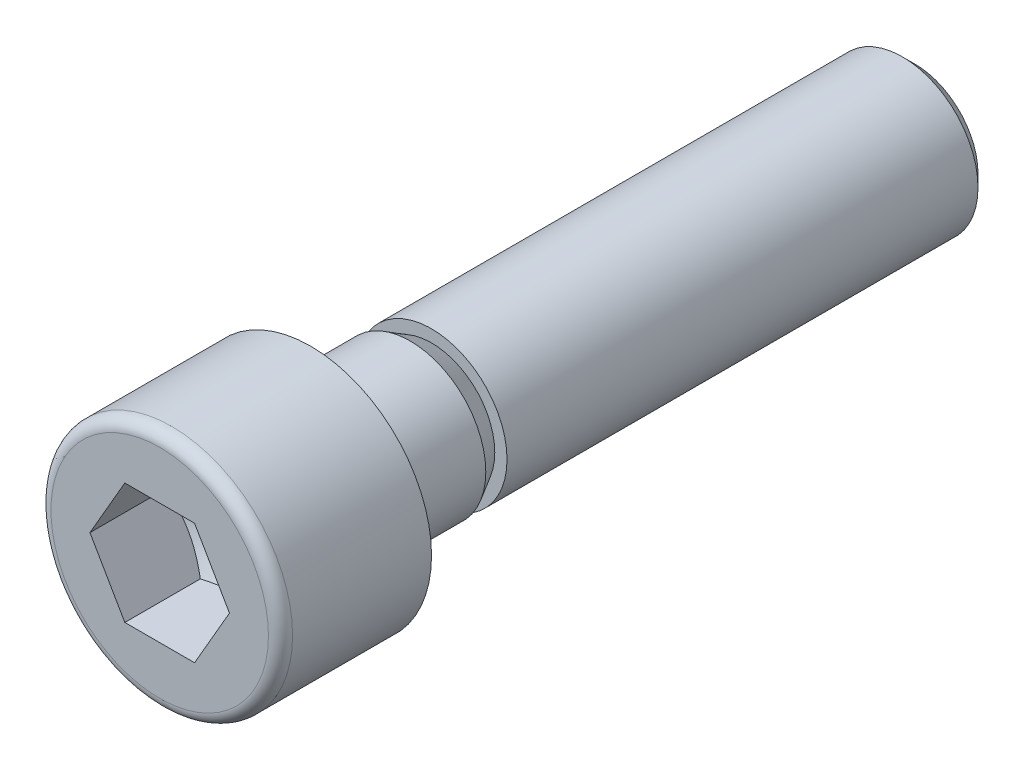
ISO-10303-21;
HEADER;
FILE_DESCRIPTION(('STEP AP214'),'2;1');
FILE_NAME('part.step','',(''),(''),'','','');
FILE_SCHEMA(('AUTOMOTIVE_DESIGN { 1 0 10303 214 1 1 1 1 }'));
ENDSEC;
DATA;
#1=APPLICATION_CONTEXT('core data for automotive mechanical design processes');
#2=APPLICATION_PROTOCOL_DEFINITION('international standard','automotive_design',2000,#1);
#3=PRODUCT_CONTEXT('',#1,'mechanical');
#4=PRODUCT('Part','Part','',(#3));
#5=PRODUCT_RELATED_PRODUCT_CATEGORY('part','',(#4));
#6=PRODUCT_DEFINITION_FORMATION('','',#4);
#7=PRODUCT_DEFINITION_CONTEXT('part definition',#1,'design');
#8=PRODUCT_DEFINITION('design','',#6,#7);
#9=PRODUCT_DEFINITION_SHAPE('','',#8);
#10=(LENGTH_UNIT() NAMED_UNIT(*) SI_UNIT(.MILLI.,.METRE.));
#11=(NAMED_UNIT(*) PLANE_ANGLE_UNIT() SI_UNIT($,.RADIAN.));
#12=(NAMED_UNIT(*) SI_UNIT($,.STERADIAN.) SOLID_ANGLE_UNIT());
#13=UNCERTAINTY_MEASURE_WITH_UNIT(LENGTH_MEASURE(1.E-05),#10,'distance_accuracy_value','');
#14=(GEOMETRIC_REPRESENTATION_CONTEXT(3) GLOBAL_UNCERTAINTY_ASSIGNED_CONTEXT((#13)) GLOBAL_UNIT_ASSIGNED_CONTEXT((#10,
#11,#12)) REPRESENTATION_CONTEXT('',''));
#15=CARTESIAN_POINT('',(0.,0.,0.));
#16=DIRECTION('',(0.,0.,1.));
#17=DIRECTION('',(1.,0.,0.));
#18=AXIS2_PLACEMENT_3D('',#15,#16,#17);
#19=CARTESIAN_POINT('',(0.,0.,10.));
#20=DIRECTION('',(0.,0.,1.));
#21=DIRECTION('',(1.,0.,0.));
#22=AXIS2_PLACEMENT_3D('',#19,#20,#21);
#23=PLANE('',#22);
#24=CARTESIAN_POINT('',(0.,0.,10.));
#25=DIRECTION('',(0.,0.,1.));
#26=DIRECTION('',(1.,0.,0.));
#27=AXIS2_PLACEMENT_3D('',#24,#25,#26);
#28=CIRCLE('',#27,7.2);
#29=CARTESIAN_POINT('',(7.2,0.,10.));
#30=VERTEX_POINT('',#29);
#31=EDGE_CURVE('E11',#30,#30,#28,.T.);
#32=ORIENTED_EDGE('',*,*,#31,.T.);
#33=EDGE_LOOP('',(#32));
#34=FACE_BOUND('',#33,.T.);
#35=DIRECTION('',(1.,0.,0.));
#36=VECTOR('',#35,1.);
#37=CARTESIAN_POINT('',(-2.3094,3.99999813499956,10.));
#38=LINE('',#37,#36);
#39=CARTESIAN_POINT('',(-2.3094,3.99999813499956,10.));
#40=VERTEX_POINT('',#39);
#41=CARTESIAN_POINT('',(2.3094,3.99999813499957,10.));
#42=VERTEX_POINT('',#41);
#43=EDGE_CURVE('E92',#40,#42,#38,.T.);
#44=ORIENTED_EDGE('',*,*,#43,.T.);
#45=DIRECTION('',(0.5,-0.866025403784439,0.));
#46=VECTOR('',#45,1.);
#47=CARTESIAN_POINT('',(2.3094,3.99999813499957,10.));
#48=LINE('',#47,#46);
#49=CARTESIAN_POINT('',(4.6188,0.,10.));
#50=VERTEX_POINT('',#49);
#51=EDGE_CURVE('E31',#42,#50,#48,.T.);
#52=ORIENTED_EDGE('',*,*,#51,.T.);
#53=DIRECTION('',(-0.5,-0.866025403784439,0.));
#54=VECTOR('',#53,1.);
#55=CARTESIAN_POINT('',(4.6188,0.,10.));
#56=LINE('',#55,#54);
#57=CARTESIAN_POINT('',(2.3094,-3.99999813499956,10.));
#58=VERTEX_POINT('',#57);
#59=EDGE_CURVE('E169',#50,#58,#56,.T.);
#60=ORIENTED_EDGE('',*,*,#59,.T.);
#61=DIRECTION('',(-1.,0.,0.));
#62=VECTOR('',#61,1.);
#63=CARTESIAN_POINT('',(2.3094,-3.99999813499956,10.));
#64=LINE('',#63,#62);
#65=CARTESIAN_POINT('',(-2.3094,-3.99999813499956,10.));
#66=VERTEX_POINT('',#65);
#67=EDGE_CURVE('E165',#58,#66,#64,.T.);
#68=ORIENTED_EDGE('',*,*,#67,.T.);
#69=DIRECTION('',(-0.5,0.866025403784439,0.));
#70=VECTOR('',#69,1.);
#71=CARTESIAN_POINT('',(-2.3094,-3.99999813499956,10.));
#72=LINE('',#71,#70);
#73=CARTESIAN_POINT('',(-4.6188,0.,10.));
#74=VERTEX_POINT('',#73);
#75=EDGE_CURVE('E160',#66,#74,#72,.T.);
#76=ORIENTED_EDGE('',*,*,#75,.T.);
#77=DIRECTION('',(0.5,0.866025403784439,0.));
#78=VECTOR('',#77,1.);
#79=CARTESIAN_POINT('',(-4.6188,0.,10.));
#80=LINE('',#79,#78);
#81=EDGE_CURVE('E96',#74,#40,#80,.T.);
#82=ORIENTED_EDGE('',*,*,#81,.T.);
#83=EDGE_LOOP('',(#44,#52,#60,#68,#76,#82));
#84=FACE_BOUND('',#83,.T.);
#85=ADVANCED_FACE('F17',(#34,#84),#23,.T.);
#86=CARTESIAN_POINT('',(0.,0.,9.2));
#87=DIRECTION('',(0.,0.,1.));
#88=DIRECTION('',(1.,0.,0.));
#89=AXIS2_PLACEMENT_3D('',#86,#87,#88);
#90=TOROIDAL_SURFACE('',#89,7.2,0.8);
#91=ORIENTED_EDGE('',*,*,#31,.F.);
#92=EDGE_LOOP('',(#91));
#93=FACE_BOUND('',#92,.T.);
#94=CARTESIAN_POINT('',(0.,0.,9.2));
#95=DIRECTION('',(0.,0.,1.));
#96=DIRECTION('',(1.,0.,0.));
#97=AXIS2_PLACEMENT_3D('',#94,#95,#96);
#98=CIRCLE('',#97,8.);
#99=CARTESIAN_POINT('',(8.,0.,9.2));
#100=VERTEX_POINT('',#99);
#101=EDGE_CURVE('E24',#100,#100,#98,.T.);
#102=ORIENTED_EDGE('',*,*,#101,.T.);
#103=EDGE_LOOP('',(#102));
#104=FACE_BOUND('',#103,.T.);
#105=ADVANCED_FACE('F133',(#93,#104),#90,.T.);
#106=CARTESIAN_POINT('',(0.,0.,10.));
#107=DIRECTION('',(0.,0.,1.));
#108=DIRECTION('',(1.,0.,0.));
#109=AXIS2_PLACEMENT_3D('',#106,#107,#108);
#110=CYLINDRICAL_SURFACE('',#109,8.);
#111=CARTESIAN_POINT('',(0.,0.,0.));
#112=DIRECTION('',(0.,0.,1.));
#113=DIRECTION('',(1.,0.,0.));
#114=AXIS2_PLACEMENT_3D('',#111,#112,#113);
#115=CIRCLE('',#114,8.);
#116=CARTESIAN_POINT('',(8.,0.,0.));
#117=VERTEX_POINT('',#116);
#118=EDGE_CURVE('E128',#117,#117,#115,.T.);
#119=ORIENTED_EDGE('',*,*,#118,.T.);
#120=EDGE_LOOP('',(#119));
#121=FACE_BOUND('',#120,.T.);
#122=ORIENTED_EDGE('',*,*,#101,.F.);
#123=EDGE_LOOP('',(#122));
#124=FACE_BOUND('',#123,.T.);
#125=ADVANCED_FACE('F135',(#121,#124),#110,.T.);
#126=CARTESIAN_POINT('',(0.,8.,0.));
#127=DIRECTION('',(0.,0.,-1.));
#128=DIRECTION('',(-1.,0.,0.));
#129=AXIS2_PLACEMENT_3D('',#126,#127,#128);
#130=PLANE('',#129);
#131=CARTESIAN_POINT('',(0.,0.,0.));
#132=DIRECTION('',(0.,0.,1.));
#133=DIRECTION('',(1.,0.,0.));
#134=AXIS2_PLACEMENT_3D('',#131,#132,#133);
#135=CIRCLE('',#134,5.5);
#136=CARTESIAN_POINT('',(5.5,0.,0.));
#137=VERTEX_POINT('',#136);
#138=EDGE_CURVE('E125',#137,#137,#135,.T.);
#139=ORIENTED_EDGE('',*,*,#138,.T.);
#140=EDGE_LOOP('',(#139));
#141=FACE_BOUND('',#140,.T.);
#142=ORIENTED_EDGE('',*,*,#118,.F.);
#143=EDGE_LOOP('',(#142));
#144=FACE_BOUND('',#143,.T.);
#145=ADVANCED_FACE('F137',(#141,#144),#130,.T.);
#146=CARTESIAN_POINT('',(0.,0.,-0.5));
#147=DIRECTION('',(0.,0.,1.));
#148=DIRECTION('',(1.,0.,0.));
#149=AXIS2_PLACEMENT_3D('',#146,#147,#148);
#150=TOROIDAL_SURFACE('',#149,5.5,0.5);
#151=CARTESIAN_POINT('',(0.,0.,-0.5));
#152=DIRECTION('',(0.,0.,1.));
#153=DIRECTION('',(1.,0.,0.));
#154=AXIS2_PLACEMENT_3D('',#151,#152,#153);
#155=CIRCLE('',#154,5.);
#156=CARTESIAN_POINT('',(5.,0.,-0.5));
#157=VERTEX_POINT('',#156);
#158=EDGE_CURVE('E122',#157,#157,#155,.T.);
#159=ORIENTED_EDGE('',*,*,#158,.T.);
#160=EDGE_LOOP('',(#159));
#161=FACE_BOUND('',#160,.T.);
#162=ORIENTED_EDGE('',*,*,#138,.F.);
#163=EDGE_LOOP('',(#162));
#164=FACE_BOUND('',#163,.T.);
#165=ADVANCED_FACE('F145',(#161,#164),#150,.F.);
#166=CARTESIAN_POINT('',(0.,0.,10.));
#167=DIRECTION('',(0.,0.,1.));
#168=DIRECTION('',(1.,0.,0.));
#169=AXIS2_PLACEMENT_3D('',#166,#167,#168);
#170=CYLINDRICAL_SURFACE('',#169,5.);
#171=CARTESIAN_POINT('',(0.,0.,-6.59379125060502));
#172=DIRECTION('',(0.,0.,1.));
#173=DIRECTION('',(1.,0.,0.));
#174=AXIS2_PLACEMENT_3D('',#171,#172,#173);
#175=CIRCLE('',#174,5.);
#176=CARTESIAN_POINT('',(5.,0.,-6.59379125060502));
#177=VERTEX_POINT('',#176);
#178=EDGE_CURVE('E119',#177,#177,#175,.T.);
#179=ORIENTED_EDGE('',*,*,#178,.T.);
#180=EDGE_LOOP('',(#179));
#181=FACE_BOUND('',#180,.T.);
#182=ORIENTED_EDGE('',*,*,#158,.F.);
#183=EDGE_LOOP('',(#182));
#184=FACE_BOUND('',#183,.T.);
#185=ADVANCED_FACE('F343',(#181,#184),#170,.T.);
#186=CARTESIAN_POINT('',(0.,0.,-6.59379125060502));
#187=DIRECTION('',(0.,0.,1.));
#188=DIRECTION('',(1.,0.,0.));
#189=AXIS2_PLACEMENT_3D('',#186,#187,#188);
#190=CONICAL_SURFACE('',#189,5.,0.523598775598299);
#191=CARTESIAN_POINT('',(0.,0.,-8.));
#192=DIRECTION('',(0.,0.,1.));
#193=DIRECTION('',(1.,0.,0.));
#194=AXIS2_PLACEMENT_3D('',#191,#192,#193);
#195=CIRCLE('',#194,4.188125);
#196=CARTESIAN_POINT('',(4.188125,0.,-8.));
#197=VERTEX_POINT('',#196);
#198=EDGE_CURVE('E116',#197,#197,#195,.T.);
#199=ORIENTED_EDGE('',*,*,#198,.T.);
#200=EDGE_LOOP('',(#199));
#201=FACE_BOUND('',#200,.T.);
#202=ORIENTED_EDGE('',*,*,#178,.F.);
#203=EDGE_LOOP('',(#202));
#204=FACE_BOUND('',#203,.T.);
#205=ADVANCED_FACE('F332',(#201,#204),#190,.T.);
#206=CARTESIAN_POINT('',(0.,4.188125,-8.));
#207=DIRECTION('',(0.,0.,1.));
#208=DIRECTION('',(1.,0.,0.));
#209=AXIS2_PLACEMENT_3D('',#206,#207,#208);
#210=PLANE('',#209);
#211=CARTESIAN_POINT('',(0.,0.,-8.));
#212=DIRECTION('',(0.,0.,1.));
#213=DIRECTION('',(1.,0.,0.));
#214=AXIS2_PLACEMENT_3D('',#211,#212,#213);
#215=CIRCLE('',#214,5.);
#216=CARTESIAN_POINT('',(5.,0.,-8.));
#217=VERTEX_POINT('',#216);
#218=EDGE_CURVE('E113',#217,#217,#215,.T.);
#219=ORIENTED_EDGE('',*,*,#218,.T.);
#220=EDGE_LOOP('',(#219));
#221=FACE_BOUND('',#220,.T.);
#222=ORIENTED_EDGE('',*,*,#198,.F.);
#223=EDGE_LOOP('',(#222));
#224=FACE_BOUND('',#223,.T.);
#225=ADVANCED_FACE('F321',(#221,#224),#210,.T.);
#226=CARTESIAN_POINT('',(0.,0.,10.));
#227=DIRECTION('',(0.,0.,1.));
#228=DIRECTION('',(1.,0.,0.));
#229=AXIS2_PLACEMENT_3D('',#226,#227,#228);
#230=CYLINDRICAL_SURFACE('',#229,5.);
#231=CARTESIAN_POINT('',(0.,0.,-39.188125));
#232=DIRECTION('',(0.,0.,1.));
#233=DIRECTION('',(1.,0.,0.));
#234=AXIS2_PLACEMENT_3D('',#231,#232,#233);
#235=CIRCLE('',#234,5.);
#236=CARTESIAN_POINT('',(5.,0.,-39.188125));
#237=VERTEX_POINT('',#236);
#238=EDGE_CURVE('E110',#237,#237,#235,.T.);
#239=ORIENTED_EDGE('',*,*,#238,.T.);
#240=EDGE_LOOP('',(#239));
#241=FACE_BOUND('',#240,.T.);
#242=ORIENTED_EDGE('',*,*,#218,.F.);
#243=EDGE_LOOP('',(#242));
#244=FACE_BOUND('',#243,.T.);
#245=ADVANCED_FACE('F310',(#241,#244),#230,.T.);
#246=CARTESIAN_POINT('',(0.,0.,-39.188125));
#247=DIRECTION('',(0.,0.,1.));
#248=DIRECTION('',(1.,0.,0.));
#249=AXIS2_PLACEMENT_3D('',#246,#247,#248);
#250=CONICAL_SURFACE('',#249,5.,0.785398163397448);
#251=CARTESIAN_POINT('',(0.,0.,-40.));
#252=DIRECTION('',(0.,0.,1.));
#253=DIRECTION('',(1.,0.,0.));
#254=AXIS2_PLACEMENT_3D('',#251,#252,#253);
#255=CIRCLE('',#254,4.188125);
#256=CARTESIAN_POINT('',(4.188125,0.,-40.));
#257=VERTEX_POINT('',#256);
#258=EDGE_CURVE('E107',#257,#257,#255,.T.);
#259=ORIENTED_EDGE('',*,*,#258,.T.);
#260=EDGE_LOOP('',(#259));
#261=FACE_BOUND('',#260,.T.);
#262=ORIENTED_EDGE('',*,*,#238,.F.);
#263=EDGE_LOOP('',(#262));
#264=FACE_BOUND('',#263,.T.);
#265=ADVANCED_FACE('F300',(#261,#264),#250,.T.);
#266=CARTESIAN_POINT('',(0.,4.188125,-40.));
#267=DIRECTION('',(0.,0.,-1.));
#268=DIRECTION('',(-1.,0.,0.));
#269=AXIS2_PLACEMENT_3D('',#266,#267,#268);
#270=PLANE('',#269);
#271=ORIENTED_EDGE('',*,*,#258,.F.);
#272=EDGE_LOOP('',(#271));
#273=FACE_BOUND('',#272,.T.);
#274=ADVANCED_FACE('F225',(#273),#270,.T.);
#275=CARTESIAN_POINT('',(2.3094,3.99999813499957,2.33333457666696));
#276=DIRECTION('',(-0.866025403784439,-0.5,0.));
#277=DIRECTION('',(-0.5,0.866025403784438,0.));
#278=AXIS2_PLACEMENT_3D('',#275,#276,#277);
#279=PLANE('',#278);
#280=DIRECTION('',(0.,0.,1.));
#281=VECTOR('',#280,1.);
#282=CARTESIAN_POINT('',(4.6188,0.,2.33333457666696));
#283=LINE('',#282,#281);
#284=CARTESIAN_POINT('',(4.6188,0.,5.));
#285=VERTEX_POINT('',#284);
#286=EDGE_CURVE('E105',#285,#50,#283,.T.);
#287=ORIENTED_EDGE('',*,*,#286,.T.);
#288=ORIENTED_EDGE('',*,*,#51,.F.);
#289=DIRECTION('',(0.,0.,1.));
#290=VECTOR('',#289,1.);
#291=CARTESIAN_POINT('',(2.3094,3.99999813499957,2.33333457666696));
#292=LINE('',#291,#290);
#293=CARTESIAN_POINT('',(2.3094,3.99999813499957,5.));
#294=VERTEX_POINT('',#293);
#295=EDGE_CURVE('E86',#294,#42,#292,.T.);
#296=ORIENTED_EDGE('',*,*,#295,.F.);
#297=CARTESIAN_POINT('',(4.61880011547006,-2.E-07,5.00000006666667));
#298=CARTESIAN_POINT('',(4.51731596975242,0.175775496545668,4.94139117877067));
#299=CARTESIAN_POINT('',(4.41495581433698,0.353068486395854,4.88808946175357));
#300=CARTESIAN_POINT('',(4.20846320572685,0.71072417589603,4.7950529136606));
#301=CARTESIAN_POINT('',(4.10432708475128,0.891093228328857,4.75535099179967));
#302=CARTESIAN_POINT('',(3.89734534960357,1.24959610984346,4.69355208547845));
#303=CARTESIAN_POINT('',(3.79453157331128,1.42767479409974,4.67104374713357));
#304=CARTESIAN_POINT('',(3.58842050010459,1.78466964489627,4.64417850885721));
#305=CARTESIAN_POINT('',(3.48512395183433,1.96358451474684,4.63979935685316));
#306=CARTESIAN_POINT('',(3.29212541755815,2.2978677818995,4.64893273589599));
#307=CARTESIAN_POINT('',(3.20239447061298,2.45328634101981,4.66020271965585));
#308=CARTESIAN_POINT('',(3.02351714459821,2.76311095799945,4.69591473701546));
#309=CARTESIAN_POINT('',(2.93437138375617,2.91751594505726,4.72036895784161));
#310=CARTESIAN_POINT('',(2.75512555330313,3.2279788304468,4.78149977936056));
#311=CARTESIAN_POINT('',(2.66504815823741,3.38399745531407,4.81843538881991));
#312=CARTESIAN_POINT('',(2.48623648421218,3.69370835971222,4.90226360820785));
#313=CARTESIAN_POINT('',(2.39749991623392,3.84740460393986,4.94913653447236));
#314=CARTESIAN_POINT('',(2.30939988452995,3.99999833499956,5.00000006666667));
#315=B_SPLINE_CURVE_WITH_KNOTS('',3,(#297,#298,#299,#300,#301,#302,#303,#304,#305,#306,#307,
#308,#309,#310,#311,#312,#313,#314),.UNSPECIFIED.,.F.,.F.,(4,2,2,2,2,2,2,2,4),(0.,
0.634031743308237,1.26958707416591,1.88941437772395,2.50848066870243,3.04741430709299,
3.58684698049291,4.13824168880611,4.6885542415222),.UNSPECIFIED.);
#316=EDGE_CURVE('E79',#285,#294,#315,.T.);
#317=ORIENTED_EDGE('',*,*,#316,.F.);
#318=EDGE_LOOP('',(#287,#288,#296,#317));
#319=FACE_BOUND('',#318,.T.);
#320=ADVANCED_FACE('F87',(#319),#279,.T.);
#321=CARTESIAN_POINT('',(4.6188,0.,2.33333457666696));
#322=DIRECTION('',(-0.866025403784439,0.5,0.));
#323=DIRECTION('',(0.5,0.866025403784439,0.));
#324=AXIS2_PLACEMENT_3D('',#321,#322,#323);
#325=PLANE('',#324);
#326=DIRECTION('',(0.,0.,1.));
#327=VECTOR('',#326,1.);
#328=CARTESIAN_POINT('',(2.3094,-3.99999813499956,2.33333457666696));
#329=LINE('',#328,#327);
#330=CARTESIAN_POINT('',(2.3094,-3.99999813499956,5.));
#331=VERTEX_POINT('',#330);
#332=EDGE_CURVE('E103',#331,#58,#329,.T.);
#333=ORIENTED_EDGE('',*,*,#332,.T.);
#334=ORIENTED_EDGE('',*,*,#59,.F.);
#335=ORIENTED_EDGE('',*,*,#286,.F.);
#336=CARTESIAN_POINT('',(2.30939988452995,-3.99999833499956,5.00000006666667));
#337=CARTESIAN_POINT('',(2.41088403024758,-3.8242226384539,4.94139117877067));
#338=CARTESIAN_POINT('',(2.51324418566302,-3.64692964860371,4.88808946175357));
#339=CARTESIAN_POINT('',(2.71973679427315,-3.28927395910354,4.7950529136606));
#340=CARTESIAN_POINT('',(2.82387291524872,-3.10890490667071,4.75535099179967));
#341=CARTESIAN_POINT('',(3.03085465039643,-2.75040202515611,4.69355208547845));
#342=CARTESIAN_POINT('',(3.13366842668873,-2.57232334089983,4.67104374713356));
#343=CARTESIAN_POINT('',(3.33977949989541,-2.2153284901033,4.64417850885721));
#344=CARTESIAN_POINT('',(3.44307604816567,-2.03641362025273,4.63979935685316));
#345=CARTESIAN_POINT('',(3.63607458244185,-1.70213035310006,4.648932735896));
#346=CARTESIAN_POINT('',(3.72580552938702,-1.54671179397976,4.66020271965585));
#347=CARTESIAN_POINT('',(3.90468285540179,-1.23688717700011,4.69591473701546));
#348=CARTESIAN_POINT('',(3.99382861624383,-1.08248218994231,4.72036895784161));
#349=CARTESIAN_POINT('',(4.17307444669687,-0.772019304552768,4.78149977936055));
#350=CARTESIAN_POINT('',(4.26315184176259,-0.61600067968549,4.8184353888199));
#351=CARTESIAN_POINT('',(4.44196351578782,-0.306289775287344,4.90226360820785));
#352=CARTESIAN_POINT('',(4.53070008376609,-0.152593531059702,4.94913653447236));
#353=CARTESIAN_POINT('',(4.61880011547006,1.99999999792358E-07,5.00000006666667));
#354=B_SPLINE_CURVE_WITH_KNOTS('',3,(#336,#337,#338,#339,#340,#341,#342,#343,#344,#345,#346,
#347,#348,#349,#350,#351,#352,#353),.UNSPECIFIED.,.F.,.F.,(4,2,2,2,2,2,2,2,4),(0.,
0.634031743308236,1.26958707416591,1.88941437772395,2.50848066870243,3.04741430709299,
3.58684698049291,4.13824168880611,4.6885542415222),.UNSPECIFIED.);
#355=EDGE_CURVE('E83',#331,#285,#354,.T.);
#356=ORIENTED_EDGE('',*,*,#355,.F.);
#357=EDGE_LOOP('',(#333,#334,#335,#356));
#358=FACE_BOUND('',#357,.T.);
#359=ADVANCED_FACE('F216',(#358),#325,.T.);
#360=CARTESIAN_POINT('',(2.3094,-3.99999813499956,2.33333457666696));
#361=DIRECTION('',(0.,1.,0.));
#362=DIRECTION('',(1.,0.,0.));
#363=AXIS2_PLACEMENT_3D('',#360,#361,#362);
#364=PLANE('',#363);
#365=DIRECTION('',(0.,0.,1.));
#366=VECTOR('',#365,1.);
#367=CARTESIAN_POINT('',(-2.3094,-3.99999813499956,2.33333457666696));
#368=LINE('',#367,#366);
#369=CARTESIAN_POINT('',(-2.3094,-3.99999813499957,5.));
#370=VERTEX_POINT('',#369);
#371=EDGE_CURVE('E101',#370,#66,#368,.T.);
#372=ORIENTED_EDGE('',*,*,#371,.T.);
#373=ORIENTED_EDGE('',*,*,#67,.F.);
#374=ORIENTED_EDGE('',*,*,#332,.F.);
#375=CARTESIAN_POINT('',(-5.98057769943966,-3.99999813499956,6.48734046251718));
#376=CARTESIAN_POINT('',(-5.80634385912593,-3.99999813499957,6.40375038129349));
#377=CARTESIAN_POINT('',(-5.63168209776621,-3.99999813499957,6.32103522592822));
#378=CARTESIAN_POINT('',(-5.28127125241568,-3.99999813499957,6.15785706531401));
#379=CARTESIAN_POINT('',(-5.10552197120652,-3.99999813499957,6.0773944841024));
#380=CARTESIAN_POINT('',(-4.75169185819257,-3.99999813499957,5.91877225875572));
#381=CARTESIAN_POINT('',(-4.57360334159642,-3.99999813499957,5.84062969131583));
#382=CARTESIAN_POINT('',(-4.21591252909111,-3.99999813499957,5.6879033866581));
#383=CARTESIAN_POINT('',(-4.03631031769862,-3.99999813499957,5.61331945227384));
#384=CARTESIAN_POINT('',(-3.67372739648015,-3.99999813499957,5.46803650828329));
#385=CARTESIAN_POINT('',(-3.49073090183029,-3.99999813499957,5.39737666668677));
#386=CARTESIAN_POINT('',(-3.12253565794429,-3.99999813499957,5.26193338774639));
#387=CARTESIAN_POINT('',(-2.93733666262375,-3.99999813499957,5.19715061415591));
#388=CARTESIAN_POINT('',(-2.56486875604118,-3.99999813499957,5.07529545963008));
#389=CARTESIAN_POINT('',(-2.37760564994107,-3.99999813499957,5.01820552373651));
#390=CARTESIAN_POINT('',(-2.00043406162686,-3.99999813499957,4.91366929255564));
#391=CARTESIAN_POINT('',(-1.81052646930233,-3.99999813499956,4.86621983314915));
#392=CARTESIAN_POINT('',(-1.42743382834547,-3.99999813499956,4.78323057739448));
#393=CARTESIAN_POINT('',(-1.23424018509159,-3.99999813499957,4.74772968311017));
#394=CARTESIAN_POINT('',(-0.84568086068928,-3.99999813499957,4.69129080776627));
#395=CARTESIAN_POINT('',(-0.650315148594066,-3.99999813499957,4.67035303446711));
#396=CARTESIAN_POINT('',(-0.259563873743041,-3.99999813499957,4.64489362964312));
#397=CARTESIAN_POINT('',(-0.0641842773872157,-3.99999813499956,4.64028273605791));
#398=CARTESIAN_POINT('',(0.326217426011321,-3.99999813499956,4.64766335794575));
#399=CARTESIAN_POINT('',(0.521239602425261,-3.99999813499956,4.65965121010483));
#400=CARTESIAN_POINT('',(0.858587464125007,-3.99999813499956,4.69392875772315));
#401=CARTESIAN_POINT('',(1.00128992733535,-3.99999813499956,4.7126822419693));
#402=CARTESIAN_POINT('',(1.28549923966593,-3.99999813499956,4.75778211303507));
#403=CARTESIAN_POINT('',(1.4270058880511,-3.99999813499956,4.78412974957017));
#404=CARTESIAN_POINT('',(1.84999884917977,-3.99999813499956,4.87324006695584));
#405=CARTESIAN_POINT('',(2.12939329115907,-3.99999813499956,4.9460057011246));
#406=CARTESIAN_POINT('',(2.54704256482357,-3.99999813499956,5.07029059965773));
#407=CARTESIAN_POINT('',(2.68750495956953,-3.99999813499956,5.11479931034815));
#408=CARTESIAN_POINT('',(2.96707353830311,-3.99999813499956,5.20796385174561));
#409=CARTESIAN_POINT('',(3.10617960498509,-3.99999813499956,5.25662003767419));
#410=CARTESIAN_POINT('',(3.38233764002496,-3.99999813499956,5.35705946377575));
#411=CARTESIAN_POINT('',(3.51939682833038,-3.99999813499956,5.40882304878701));
#412=CARTESIAN_POINT('',(3.79237111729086,-3.99999813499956,5.51515891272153));
#413=CARTESIAN_POINT('',(3.92828658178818,-3.99999813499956,5.56973025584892));
#414=CARTESIAN_POINT('',(4.06372392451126,-3.99999813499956,5.62543811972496));
#415=B_SPLINE_CURVE_WITH_KNOTS('',3,(#375,#376,#377,#378,#379,#380,#381,#382,#383,#384,#385,
#386,#387,#388,#389,#390,#391,#392,#393,#394,#395,#396,#397,#398,#399,#400,#401,#402,#403,#404,
#405,#406,#407,#408,#409,#410,#411,#412,#413,#414),.UNSPECIFIED.,.F.,.F.,(4,2,2,2,2,2,2,2,2,2,2,
2,2,2,2,2,2,2,2,4),(0.,0.579752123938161,1.15961265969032,1.74301648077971,2.32638794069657,
2.91480363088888,3.50328569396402,4.09040124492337,4.67732378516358,5.26613914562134,
5.85496290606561,6.4405624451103,7.02603276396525,7.45760764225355,7.88925358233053,
8.75424356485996,9.19624933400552,9.63829299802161,10.0777870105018,10.5171354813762),.UNSPECIFIED.);
#416=EDGE_CURVE('E207',#370,#331,#415,.T.);
#417=ORIENTED_EDGE('',*,*,#416,.F.);
#418=EDGE_LOOP('',(#372,#373,#374,#417));
#419=FACE_BOUND('',#418,.T.);
#420=ADVANCED_FACE('F212',(#419),#364,.T.);
#421=CARTESIAN_POINT('',(-2.3094,-3.99999813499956,2.33333457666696));
#422=DIRECTION('',(0.866025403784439,0.5,0.));
#423=DIRECTION('',(0.5,-0.866025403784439,0.));
#424=AXIS2_PLACEMENT_3D('',#421,#422,#423);
#425=PLANE('',#424);
#426=DIRECTION('',(0.,0.,1.));
#427=VECTOR('',#426,1.);
#428=CARTESIAN_POINT('',(-4.6188,0.,2.33333457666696));
#429=LINE('',#428,#427);
#430=CARTESIAN_POINT('',(-4.6188,0.,5.));
#431=VERTEX_POINT('',#430);
#432=EDGE_CURVE('E94',#431,#74,#429,.T.);
#433=ORIENTED_EDGE('',*,*,#432,.T.);
#434=ORIENTED_EDGE('',*,*,#75,.F.);
#435=ORIENTED_EDGE('',*,*,#371,.F.);
#436=CARTESIAN_POINT('',(-4.61880011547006,2.00000001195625E-07,5.00000006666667));
#437=CARTESIAN_POINT('',(-4.51731596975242,-0.175775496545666,4.94139117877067));
#438=CARTESIAN_POINT('',(-4.41495581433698,-0.353068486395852,4.88808946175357));
#439=CARTESIAN_POINT('',(-4.20846320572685,-0.710724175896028,4.7950529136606));
#440=CARTESIAN_POINT('',(-4.10432708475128,-0.891093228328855,4.75535099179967));
#441=CARTESIAN_POINT('',(-3.89734534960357,-1.24959610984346,4.69355208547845));
#442=CARTESIAN_POINT('',(-3.79453157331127,-1.42767479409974,4.67104374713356));
#443=CARTESIAN_POINT('',(-3.58842050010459,-1.78466964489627,4.64417850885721));
#444=CARTESIAN_POINT('',(-3.48512395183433,-1.96358451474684,4.63979935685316));
#445=CARTESIAN_POINT('',(-3.29212541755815,-2.2978677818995,4.648932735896));
#446=CARTESIAN_POINT('',(-3.20239447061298,-2.45328634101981,4.66020271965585));
#447=CARTESIAN_POINT('',(-3.02351714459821,-2.76311095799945,4.69591473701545));
#448=CARTESIAN_POINT('',(-2.93437138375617,-2.91751594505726,4.72036895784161));
#449=CARTESIAN_POINT('',(-2.75512555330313,-3.2279788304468,4.78149977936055));
#450=CARTESIAN_POINT('',(-2.66504815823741,-3.38399745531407,4.8184353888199));
#451=CARTESIAN_POINT('',(-2.48623648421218,-3.69370835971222,4.90226360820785));
#452=CARTESIAN_POINT('',(-2.39749991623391,-3.84740460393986,4.94913653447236));
#453=CARTESIAN_POINT('',(-2.30939988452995,-3.99999833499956,5.00000006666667));
#454=B_SPLINE_CURVE_WITH_KNOTS('',3,(#436,#437,#438,#439,#440,#441,#442,#443,#444,#445,#446,
#447,#448,#449,#450,#451,#452,#453),.UNSPECIFIED.,.F.,.F.,(4,2,2,2,2,2,2,2,4),(0.,
0.634031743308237,1.26958707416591,1.88941437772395,2.50848066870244,3.047414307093,
3.58684698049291,4.13824168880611,4.6885542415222),.UNSPECIFIED.);
#455=EDGE_CURVE('E202',#431,#370,#454,.T.);
#456=ORIENTED_EDGE('',*,*,#455,.F.);
#457=EDGE_LOOP('',(#433,#434,#435,#456));
#458=FACE_BOUND('',#457,.T.);
#459=ADVANCED_FACE('F215',(#458),#425,.T.);
#460=CARTESIAN_POINT('',(-4.6188,0.,2.33333457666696));
#461=DIRECTION('',(0.866025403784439,-0.5,0.));
#462=DIRECTION('',(-0.5,-0.866025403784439,0.));
#463=AXIS2_PLACEMENT_3D('',#460,#461,#462);
#464=PLANE('',#463);
#465=DIRECTION('',(0.,0.,1.));
#466=VECTOR('',#465,1.);
#467=CARTESIAN_POINT('',(-2.3094,3.99999813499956,2.33333457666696));
#468=LINE('',#467,#466);
#469=CARTESIAN_POINT('',(-2.3094,3.99999813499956,5.));
#470=VERTEX_POINT('',#469);
#471=EDGE_CURVE('E91',#470,#40,#468,.T.);
#472=ORIENTED_EDGE('',*,*,#471,.T.);
#473=ORIENTED_EDGE('',*,*,#81,.F.);
#474=ORIENTED_EDGE('',*,*,#432,.F.);
#475=CARTESIAN_POINT('',(-2.30939988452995,3.99999833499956,5.00000006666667));
#476=CARTESIAN_POINT('',(-2.41088403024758,3.8242226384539,4.94139117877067));
#477=CARTESIAN_POINT('',(-2.51324418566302,3.64692964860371,4.88808946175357));
#478=CARTESIAN_POINT('',(-2.71973679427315,3.28927395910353,4.7950529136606));
#479=CARTESIAN_POINT('',(-2.82387291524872,3.1089049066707,4.75535099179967));
#480=CARTESIAN_POINT('',(-3.03085465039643,2.7504020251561,4.69355208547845));
#481=CARTESIAN_POINT('',(-3.13366842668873,2.57232334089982,4.67104374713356));
#482=CARTESIAN_POINT('',(-3.33977949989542,2.21532849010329,4.64417850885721));
#483=CARTESIAN_POINT('',(-3.44307604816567,2.03641362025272,4.63979935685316));
#484=CARTESIAN_POINT('',(-3.63607458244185,1.70213035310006,4.648932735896));
#485=CARTESIAN_POINT('',(-3.72580552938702,1.54671179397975,4.66020271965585));
#486=CARTESIAN_POINT('',(-3.90468285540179,1.23688717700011,4.69591473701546));
#487=CARTESIAN_POINT('',(-3.99382861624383,1.08248218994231,4.72036895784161));
#488=CARTESIAN_POINT('',(-4.17307444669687,0.772019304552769,4.78149977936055));
#489=CARTESIAN_POINT('',(-4.26315184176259,0.616000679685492,4.8184353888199));
#490=CARTESIAN_POINT('',(-4.44196351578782,0.306289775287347,4.90226360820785));
#491=CARTESIAN_POINT('',(-4.53070008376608,0.152593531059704,4.94913653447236));
#492=CARTESIAN_POINT('',(-4.61880011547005,-1.99999998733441E-07,5.00000006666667));
#493=B_SPLINE_CURVE_WITH_KNOTS('',3,(#475,#476,#477,#478,#479,#480,#481,#482,#483,#484,#485,
#486,#487,#488,#489,#490,#491,#492),.UNSPECIFIED.,.F.,.F.,(4,2,2,2,2,2,2,2,4),(0.,
0.634031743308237,1.26958707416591,1.88941437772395,2.50848066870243,3.04741430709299,
3.58684698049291,4.1382416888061,4.68855424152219),.UNSPECIFIED.);
#494=EDGE_CURVE('E39',#470,#431,#493,.T.);
#495=ORIENTED_EDGE('',*,*,#494,.F.);
#496=EDGE_LOOP('',(#472,#473,#474,#495));
#497=FACE_BOUND('',#496,.T.);
#498=ADVANCED_FACE('F159',(#497),#464,.T.);
#499=CARTESIAN_POINT('',(-2.3094,3.99999813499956,2.33333457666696));
#500=DIRECTION('',(0.,-1.,0.));
#501=DIRECTION('',(-1.,0.,0.));
#502=AXIS2_PLACEMENT_3D('',#499,#500,#501);
#503=PLANE('',#502);
#504=ORIENTED_EDGE('',*,*,#295,.T.);
#505=ORIENTED_EDGE('',*,*,#43,.F.);
#506=ORIENTED_EDGE('',*,*,#471,.F.);
#507=CARTESIAN_POINT('',(-5.98057769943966,3.99999813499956,6.48734046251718));
#508=CARTESIAN_POINT('',(-5.80634385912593,3.99999813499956,6.4037503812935));
#509=CARTESIAN_POINT('',(-5.63168209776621,3.99999813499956,6.32103522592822));
#510=CARTESIAN_POINT('',(-5.28127125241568,3.99999813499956,6.15785706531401));
#511=CARTESIAN_POINT('',(-5.10552197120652,3.99999813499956,6.0773944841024));
#512=CARTESIAN_POINT('',(-4.75169185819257,3.99999813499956,5.91877225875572));
#513=CARTESIAN_POINT('',(-4.57360334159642,3.99999813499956,5.84062969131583));
#514=CARTESIAN_POINT('',(-4.21591252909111,3.99999813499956,5.6879033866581));
#515=CARTESIAN_POINT('',(-4.03631031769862,3.99999813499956,5.61331945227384));
#516=CARTESIAN_POINT('',(-3.67372739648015,3.99999813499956,5.46803650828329));
#517=CARTESIAN_POINT('',(-3.49073090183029,3.99999813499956,5.39737666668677));
#518=CARTESIAN_POINT('',(-3.12253565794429,3.99999813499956,5.26193338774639));
#519=CARTESIAN_POINT('',(-2.93733666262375,3.99999813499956,5.19715061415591));
#520=CARTESIAN_POINT('',(-2.56486875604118,3.99999813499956,5.07529545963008));
#521=CARTESIAN_POINT('',(-2.37760564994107,3.99999813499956,5.01820552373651));
#522=CARTESIAN_POINT('',(-2.00043406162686,3.99999813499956,4.91366929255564));
#523=CARTESIAN_POINT('',(-1.81052646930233,3.99999813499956,4.86621983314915));
#524=CARTESIAN_POINT('',(-1.42743382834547,3.99999813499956,4.78323057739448));
#525=CARTESIAN_POINT('',(-1.23424018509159,3.99999813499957,4.74772968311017));
#526=CARTESIAN_POINT('',(-0.845680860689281,3.99999813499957,4.69129080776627));
#527=CARTESIAN_POINT('',(-0.650315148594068,3.99999813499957,4.67035303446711));
#528=CARTESIAN_POINT('',(-0.259563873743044,3.99999813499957,4.64489362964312));
#529=CARTESIAN_POINT('',(-0.0641842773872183,3.99999813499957,4.64028273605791));
#530=CARTESIAN_POINT('',(0.326217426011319,3.99999813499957,4.64766335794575));
#531=CARTESIAN_POINT('',(0.521239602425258,3.99999813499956,4.65965121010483));
#532=CARTESIAN_POINT('',(0.858587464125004,3.99999813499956,4.69392875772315));
#533=CARTESIAN_POINT('',(1.00128992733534,3.99999813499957,4.7126822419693));
#534=CARTESIAN_POINT('',(1.28549923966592,3.99999813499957,4.75778211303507));
#535=CARTESIAN_POINT('',(1.42700588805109,3.99999813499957,4.78412974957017));
#536=CARTESIAN_POINT('',(1.84999884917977,3.99999813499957,4.87324006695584));
#537=CARTESIAN_POINT('',(2.12939329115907,3.99999813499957,4.9460057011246));
#538=CARTESIAN_POINT('',(2.54704256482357,3.99999813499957,5.07029059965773));
#539=CARTESIAN_POINT('',(2.68750495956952,3.99999813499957,5.11479931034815));
#540=CARTESIAN_POINT('',(2.96707353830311,3.99999813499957,5.20796385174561));
#541=CARTESIAN_POINT('',(3.10617960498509,3.99999813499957,5.25662003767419));
#542=CARTESIAN_POINT('',(3.38233764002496,3.99999813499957,5.35705946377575));
#543=CARTESIAN_POINT('',(3.51939682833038,3.99999813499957,5.40882304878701));
#544=CARTESIAN_POINT('',(3.79237111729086,3.99999813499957,5.51515891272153));
#545=CARTESIAN_POINT('',(3.92828658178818,3.99999813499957,5.56973025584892));
#546=CARTESIAN_POINT('',(4.06372392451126,3.99999813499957,5.62543811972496));
#547=B_SPLINE_CURVE_WITH_KNOTS('',3,(#507,#508,#509,#510,#511,#512,#513,#514,#515,#516,#517,
#518,#519,#520,#521,#522,#523,#524,#525,#526,#527,#528,#529,#530,#531,#532,#533,#534,#535,#536,
#537,#538,#539,#540,#541,#542,#543,#544,#545,#546),.UNSPECIFIED.,.F.,.F.,(4,2,2,2,2,2,2,2,2,2,2,
2,2,2,2,2,2,2,2,4),(0.,0.579752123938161,1.15961265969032,1.74301648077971,2.32638794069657,
2.91480363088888,3.50328569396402,4.09040124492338,4.67732378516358,5.26613914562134,
5.85496290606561,6.44056244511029,7.02603276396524,7.45760764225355,7.88925358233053,
8.75424356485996,9.19624933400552,9.6382929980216,10.0777870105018,10.5171354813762),.UNSPECIFIED.);
#548=EDGE_CURVE('E80',#294,#470,#547,.F.);
#549=ORIENTED_EDGE('',*,*,#548,.F.);
#550=EDGE_LOOP('',(#504,#505,#506,#549));
#551=FACE_BOUND('',#550,.T.);
#552=ADVANCED_FACE('F75',(#551),#503,.T.);
#553=CARTESIAN_POINT('',(0.,0.,2.33333457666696));
#554=DIRECTION('',(0.,0.,1.));
#555=DIRECTION('',(1.,0.,0.));
#556=AXIS2_PLACEMENT_3D('',#553,#554,#555);
#557=CONICAL_SURFACE('',#556,0.,1.0471975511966);
#558=CARTESIAN_POINT('',(0.,0.,2.33333457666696));
#559=VERTEX_POINT('',#558);
#560=VERTEX_LOOP('',#559);
#561=FACE_BOUND('',#560,.T.);
#562=ORIENTED_EDGE('',*,*,#316,.T.);
#563=ORIENTED_EDGE('',*,*,#548,.T.);
#564=ORIENTED_EDGE('',*,*,#494,.T.);
#565=ORIENTED_EDGE('',*,*,#455,.T.);
#566=ORIENTED_EDGE('',*,*,#416,.T.);
#567=ORIENTED_EDGE('',*,*,#355,.T.);
#568=EDGE_LOOP('',(#562,#563,#564,#565,#566,#567));
#569=FACE_BOUND('',#568,.T.);
#570=ADVANCED_FACE('F72',(#561,#569),#557,.F.);
#571=CLOSED_SHELL('',(#85,#105,#125,#145,#165,#185,#205,#225,#245,#265,#274,#320,#359,#420,#459,
#498,#552,#570));
#572=MANIFOLD_SOLID_BREP('B1',#571);
#573=ADVANCED_BREP_SHAPE_REPRESENTATION('',(#18,#572),#14);
#574=SHAPE_DEFINITION_REPRESENTATION(#9,#573);
ENDSEC;
END-ISO-10303-21;
